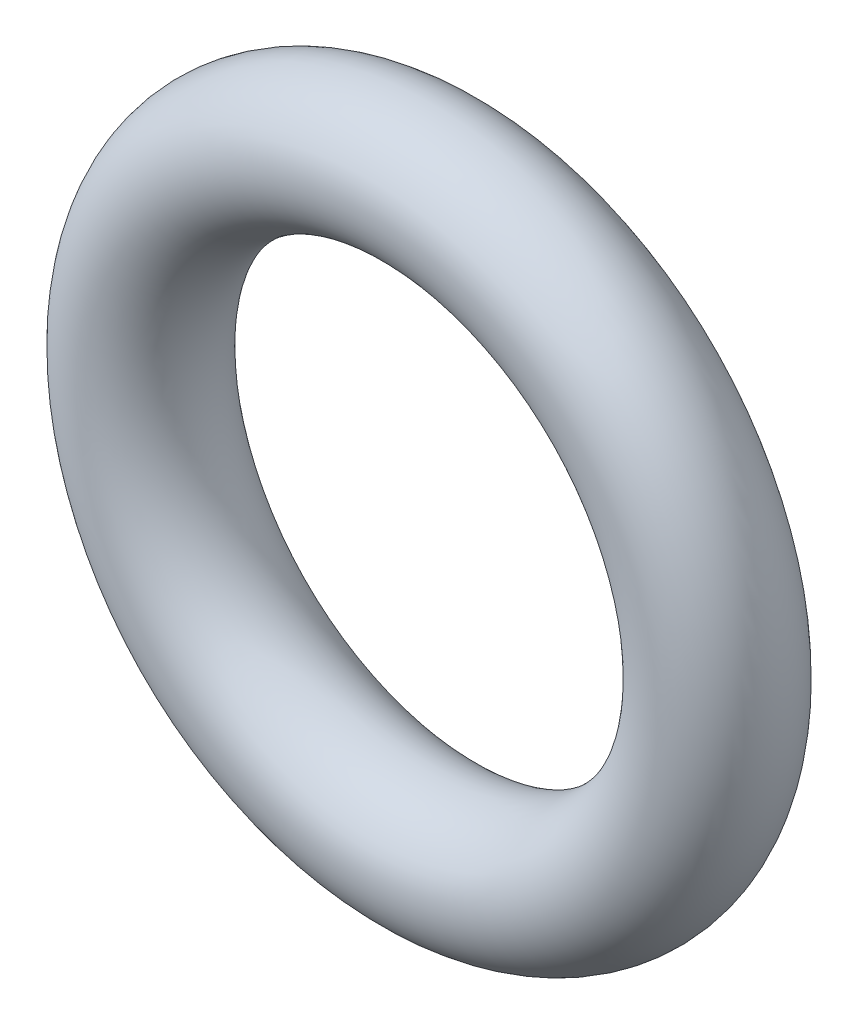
ISO-10303-21;
HEADER;
FILE_DESCRIPTION(('STEP AP214'),'2;1');
FILE_NAME('part.step','',(''),(''),'','','');
FILE_SCHEMA(('AUTOMOTIVE_DESIGN { 1 0 10303 214 1 1 1 1 }'));
ENDSEC;
DATA;
#1=APPLICATION_CONTEXT('core data for automotive mechanical design processes');
#2=APPLICATION_PROTOCOL_DEFINITION('international standard','automotive_design',2000,#1);
#3=PRODUCT_CONTEXT('',#1,'mechanical');
#4=PRODUCT('Part','Part','',(#3));
#5=PRODUCT_RELATED_PRODUCT_CATEGORY('part','',(#4));
#6=PRODUCT_DEFINITION_FORMATION('','',#4);
#7=PRODUCT_DEFINITION_CONTEXT('part definition',#1,'design');
#8=PRODUCT_DEFINITION('design','',#6,#7);
#9=PRODUCT_DEFINITION_SHAPE('','',#8);
#10=(LENGTH_UNIT() NAMED_UNIT(*) SI_UNIT(.MILLI.,.METRE.));
#11=(NAMED_UNIT(*) PLANE_ANGLE_UNIT() SI_UNIT($,.RADIAN.));
#12=(NAMED_UNIT(*) SI_UNIT($,.STERADIAN.) SOLID_ANGLE_UNIT());
#13=UNCERTAINTY_MEASURE_WITH_UNIT(LENGTH_MEASURE(1.E-05),#10,'distance_accuracy_value','');
#14=(GEOMETRIC_REPRESENTATION_CONTEXT(3) GLOBAL_UNCERTAINTY_ASSIGNED_CONTEXT((#13)) GLOBAL_UNIT_ASSIGNED_CONTEXT((#10,
#11,#12)) REPRESENTATION_CONTEXT('',''));
#15=CARTESIAN_POINT('',(0.,0.,0.));
#16=DIRECTION('',(0.,0.,1.));
#17=DIRECTION('',(1.,0.,0.));
#18=AXIS2_PLACEMENT_3D('',#15,#16,#17);
#19=CARTESIAN_POINT('',(0.,0.,0.75));
#20=DIRECTION('',(0.,0.,-1.));
#21=DIRECTION('',(-1.,0.,0.));
#22=AXIS2_PLACEMENT_3D('',#19,#20,#21);
#23=TOROIDAL_SURFACE('',#22,3.25,0.75);
#24=ADVANCED_FACE('F13',(),#23,.T.);
#25=CLOSED_SHELL('',(#24));
#26=MANIFOLD_SOLID_BREP('B1',#25);
#27=ADVANCED_BREP_SHAPE_REPRESENTATION('',(#18,#26),#14);
#28=SHAPE_DEFINITION_REPRESENTATION(#9,#27);
ENDSEC;
END-ISO-10303-21;
